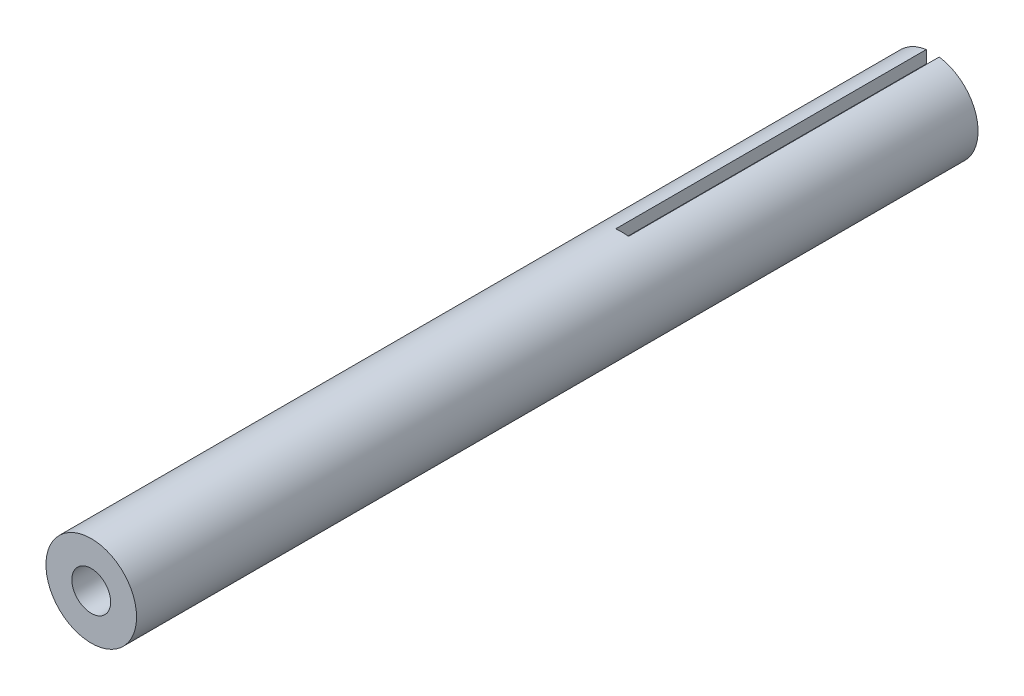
from build123d import *

# Parameters (mm, degrees)
SKETCH1_R           = 11.1125
SKETCH1_R_2         = 4.7625
BOSS_EXTRUDE1_DEPTH = 206.375
SKETCH2_W           = 3.175
SKETCH2_H           = 76.2
CUT_EXTRUDE1_DEPTH  = 3.175


with BuildPart() as part:
    # Sketch1 → Boss-Extrude1 (new body)
    with BuildSketch(Plane.XY):
        Circle(SKETCH1_R)
        Circle(SKETCH1_R_2, mode=Mode.SUBTRACT)
    extrude(amount=BOSS_EXTRUDE1_DEPTH)

    # Sketch2 → Cut-Extrude1 (cut)
    with BuildSketch(Plane(origin=(0, 11.1125, 0), x_dir=(1, 0, 0), z_dir=(0, 1, 0))):
        with Locations((0, -38.1)):
            Rectangle(SKETCH2_W, SKETCH2_H)
    extrude(amount=-CUT_EXTRUDE1_DEPTH, mode=Mode.SUBTRACT)


solid = part.part
